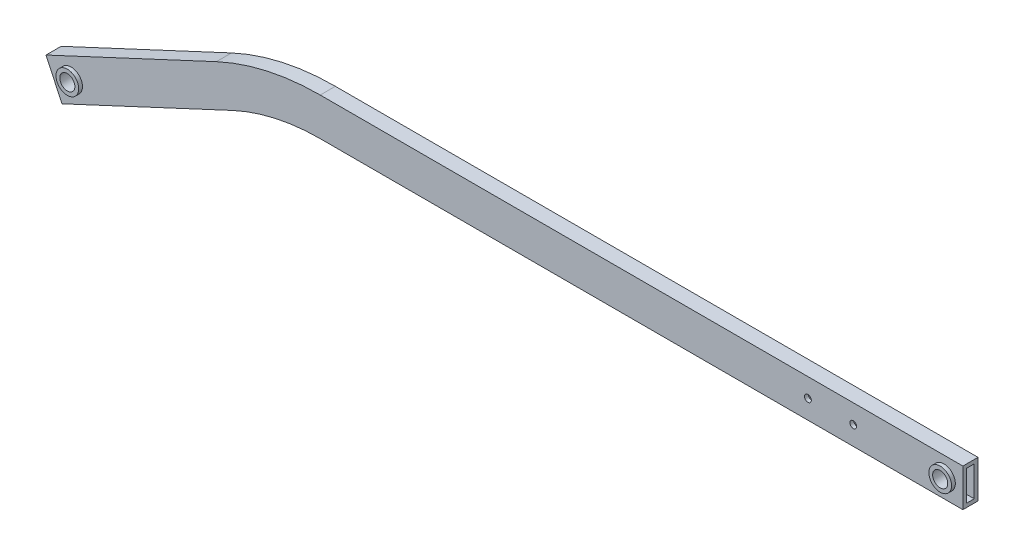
ISO-10303-21;
HEADER;
FILE_DESCRIPTION(('STEP AP214'),'2;1');
FILE_NAME('part.step','',(''),(''),'','','');
FILE_SCHEMA(('AUTOMOTIVE_DESIGN { 1 0 10303 214 1 1 1 1 }'));
ENDSEC;
DATA;
#1=APPLICATION_CONTEXT('core data for automotive mechanical design processes');
#2=APPLICATION_PROTOCOL_DEFINITION('international standard','automotive_design',2000,#1);
#3=PRODUCT_CONTEXT('',#1,'mechanical');
#4=PRODUCT('Part','Part','',(#3));
#5=PRODUCT_RELATED_PRODUCT_CATEGORY('part','',(#4));
#6=PRODUCT_DEFINITION_FORMATION('','',#4);
#7=PRODUCT_DEFINITION_CONTEXT('part definition',#1,'design');
#8=PRODUCT_DEFINITION('design','',#6,#7);
#9=PRODUCT_DEFINITION_SHAPE('','',#8);
#10=(LENGTH_UNIT() NAMED_UNIT(*) SI_UNIT(.MILLI.,.METRE.));
#11=(NAMED_UNIT(*) PLANE_ANGLE_UNIT() SI_UNIT($,.RADIAN.));
#12=(NAMED_UNIT(*) SI_UNIT($,.STERADIAN.) SOLID_ANGLE_UNIT());
#13=UNCERTAINTY_MEASURE_WITH_UNIT(LENGTH_MEASURE(1.E-05),#10,'distance_accuracy_value','');
#14=(GEOMETRIC_REPRESENTATION_CONTEXT(3) GLOBAL_UNCERTAINTY_ASSIGNED_CONTEXT((#13)) GLOBAL_UNIT_ASSIGNED_CONTEXT((#10,
#11,#12)) REPRESENTATION_CONTEXT('',''));
#15=CARTESIAN_POINT('',(0.,0.,0.));
#16=DIRECTION('',(0.,0.,1.));
#17=DIRECTION('',(1.,0.,0.));
#18=AXIS2_PLACEMENT_3D('',#15,#16,#17);
#19=CARTESIAN_POINT('',(-987.350935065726,-5.44996921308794,10.));
#20=DIRECTION('',(0.422618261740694,-0.906307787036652,0.));
#21=DIRECTION('',(0.906307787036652,0.422618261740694,0.));
#22=AXIS2_PLACEMENT_3D('',#19,#20,#21);
#23=PLANE('',#22);
#24=DIRECTION('',(0.,0.,1.));
#25=VECTOR('',#24,1.);
#26=CARTESIAN_POINT('',(-987.350935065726,-5.44996921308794,10.));
#27=LINE('',#26,#25);
#28=CARTESIAN_POINT('',(-987.350935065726,-5.44996921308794,-10.));
#29=VERTEX_POINT('',#28);
#30=CARTESIAN_POINT('',(-987.350935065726,-5.44996921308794,10.));
#31=VERTEX_POINT('',#30);
#32=EDGE_CURVE('E223',#29,#31,#27,.T.);
#33=ORIENTED_EDGE('',*,*,#32,.F.);
#34=DIRECTION('',(-0.906307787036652,-0.422618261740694,0.));
#35=VECTOR('',#34,1.);
#36=CARTESIAN_POINT('',(-987.350935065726,-5.44996921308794,-10.));
#37=LINE('',#36,#35);
#38=CARTESIAN_POINT('',(-1212.71545654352,-110.539171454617,-10.));
#39=VERTEX_POINT('',#38);
#40=EDGE_CURVE('E35',#29,#39,#37,.T.);
#41=ORIENTED_EDGE('',*,*,#40,.T.);
#42=DIRECTION('',(0.,0.,1.));
#43=VECTOR('',#42,1.);
#44=CARTESIAN_POINT('',(-1212.71545654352,-110.539171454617,10.));
#45=LINE('',#44,#43);
#46=CARTESIAN_POINT('',(-1212.71545654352,-110.539171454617,10.));
#47=VERTEX_POINT('',#46);
#48=EDGE_CURVE('E43',#39,#47,#45,.T.);
#49=ORIENTED_EDGE('',*,*,#48,.T.);
#50=DIRECTION('',(-0.906307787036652,-0.422618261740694,0.));
#51=VECTOR('',#50,1.);
#52=CARTESIAN_POINT('',(-987.350935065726,-5.44996921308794,10.));
#53=LINE('',#52,#51);
#54=EDGE_CURVE('E11',#31,#47,#53,.T.);
#55=ORIENTED_EDGE('',*,*,#54,.F.);
#56=EDGE_LOOP('',(#33,#41,#49,#55));
#57=FACE_BOUND('',#56,.T.);
#58=ADVANCED_FACE('F27',(#57),#23,.F.);
#59=CARTESIAN_POINT('',(-966.220021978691,-50.7653585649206,10.));
#60=DIRECTION('',(-0.422618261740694,0.906307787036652,0.));
#61=DIRECTION('',(-0.906307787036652,-0.422618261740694,0.));
#62=AXIS2_PLACEMENT_3D('',#59,#60,#61);
#63=PLANE('',#62);
#64=DIRECTION('',(0.,0.,-1.));
#65=VECTOR('',#64,1.);
#66=CARTESIAN_POINT('',(-966.220021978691,-50.7653585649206,10.));
#67=LINE('',#66,#65);
#68=CARTESIAN_POINT('',(-966.220021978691,-50.7653585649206,10.));
#69=VERTEX_POINT('',#68);
#70=CARTESIAN_POINT('',(-966.220021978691,-50.7653585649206,-10.));
#71=VERTEX_POINT('',#70);
#72=EDGE_CURVE('E220',#69,#71,#67,.T.);
#73=ORIENTED_EDGE('',*,*,#72,.F.);
#74=DIRECTION('',(-0.906307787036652,-0.422618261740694,0.));
#75=VECTOR('',#74,1.);
#76=CARTESIAN_POINT('',(-966.220021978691,-50.7653585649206,10.));
#77=LINE('',#76,#75);
#78=CARTESIAN_POINT('',(-1191.58454345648,-155.85456080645,10.));
#79=VERTEX_POINT('',#78);
#80=EDGE_CURVE('E268',#69,#79,#77,.T.);
#81=ORIENTED_EDGE('',*,*,#80,.T.);
#82=DIRECTION('',(0.,0.,-1.));
#83=VECTOR('',#82,1.);
#84=CARTESIAN_POINT('',(-1191.58454345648,-155.85456080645,10.));
#85=LINE('',#84,#83);
#86=CARTESIAN_POINT('',(-1191.58454345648,-155.85456080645,-10.));
#87=VERTEX_POINT('',#86);
#88=EDGE_CURVE('E263',#79,#87,#85,.T.);
#89=ORIENTED_EDGE('',*,*,#88,.T.);
#90=DIRECTION('',(-0.906307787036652,-0.422618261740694,0.));
#91=VECTOR('',#90,1.);
#92=CARTESIAN_POINT('',(-966.220021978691,-50.7653585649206,-10.));
#93=LINE('',#92,#91);
#94=EDGE_CURVE('E281',#71,#87,#93,.T.);
#95=ORIENTED_EDGE('',*,*,#94,.F.);
#96=EDGE_LOOP('',(#73,#81,#89,#95));
#97=FACE_BOUND('',#96,.T.);
#98=ADVANCED_FACE('F382',(#97),#63,.F.);
#99=CARTESIAN_POINT('',(-968.333113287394,-46.2338196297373,5.));
#100=DIRECTION('',(-0.422618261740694,0.906307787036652,0.));
#101=DIRECTION('',(-0.906307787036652,-0.422618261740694,0.));
#102=AXIS2_PLACEMENT_3D('',#99,#100,#101);
#103=PLANE('',#102);
#104=DIRECTION('',(0.,0.,-1.));
#105=VECTOR('',#104,1.);
#106=CARTESIAN_POINT('',(-968.333113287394,-46.2338196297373,5.));
#107=LINE('',#106,#105);
#108=CARTESIAN_POINT('',(-968.333113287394,-46.2338196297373,5.));
#109=VERTEX_POINT('',#108);
#110=CARTESIAN_POINT('',(-968.333113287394,-46.2338196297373,-5.));
#111=VERTEX_POINT('',#110);
#112=EDGE_CURVE('E217',#109,#111,#107,.T.);
#113=ORIENTED_EDGE('',*,*,#112,.T.);
#114=DIRECTION('',(-0.906307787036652,-0.422618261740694,0.));
#115=VECTOR('',#114,1.);
#116=CARTESIAN_POINT('',(-968.333113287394,-46.2338196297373,-5.));
#117=LINE('',#116,#115);
#118=CARTESIAN_POINT('',(-1193.69763476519,-151.323021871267,-5.));
#119=VERTEX_POINT('',#118);
#120=EDGE_CURVE('E274',#111,#119,#117,.T.);
#121=ORIENTED_EDGE('',*,*,#120,.T.);
#122=DIRECTION('',(0.,0.,-1.));
#123=VECTOR('',#122,1.);
#124=CARTESIAN_POINT('',(-1193.69763476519,-151.323021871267,5.));
#125=LINE('',#124,#123);
#126=CARTESIAN_POINT('',(-1193.69763476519,-151.323021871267,5.));
#127=VERTEX_POINT('',#126);
#128=EDGE_CURVE('E257',#127,#119,#125,.T.);
#129=ORIENTED_EDGE('',*,*,#128,.F.);
#130=DIRECTION('',(-0.906307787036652,-0.422618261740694,0.));
#131=VECTOR('',#130,1.);
#132=CARTESIAN_POINT('',(-968.333113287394,-46.2338196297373,5.));
#133=LINE('',#132,#131);
#134=EDGE_CURVE('E264',#109,#127,#133,.T.);
#135=ORIENTED_EDGE('',*,*,#134,.F.);
#136=EDGE_LOOP('',(#113,#121,#129,#135));
#137=FACE_BOUND('',#136,.T.);
#138=ADVANCED_FACE('F400',(#137),#103,.T.);
#139=CARTESIAN_POINT('',(-985.237843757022,-9.9815081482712,5.));
#140=DIRECTION('',(0.422618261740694,-0.906307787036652,0.));
#141=DIRECTION('',(0.906307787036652,0.422618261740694,0.));
#142=AXIS2_PLACEMENT_3D('',#139,#140,#141);
#143=PLANE('',#142);
#144=DIRECTION('',(0.,0.,1.));
#145=VECTOR('',#144,1.);
#146=CARTESIAN_POINT('',(-985.237843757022,-9.9815081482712,5.));
#147=LINE('',#146,#145);
#148=CARTESIAN_POINT('',(-985.237843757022,-9.9815081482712,-5.));
#149=VERTEX_POINT('',#148);
#150=CARTESIAN_POINT('',(-985.237843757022,-9.9815081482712,5.));
#151=VERTEX_POINT('',#150);
#152=EDGE_CURVE('E202',#149,#151,#147,.T.);
#153=ORIENTED_EDGE('',*,*,#152,.T.);
#154=DIRECTION('',(-0.906307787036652,-0.422618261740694,0.));
#155=VECTOR('',#154,1.);
#156=CARTESIAN_POINT('',(-985.237843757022,-9.9815081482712,5.));
#157=LINE('',#156,#155);
#158=CARTESIAN_POINT('',(-1210.60236523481,-115.070710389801,5.));
#159=VERTEX_POINT('',#158);
#160=EDGE_CURVE('E260',#151,#159,#157,.T.);
#161=ORIENTED_EDGE('',*,*,#160,.T.);
#162=DIRECTION('',(0.,0.,1.));
#163=VECTOR('',#162,1.);
#164=CARTESIAN_POINT('',(-1210.60236523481,-115.070710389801,5.));
#165=LINE('',#164,#163);
#166=CARTESIAN_POINT('',(-1210.60236523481,-115.070710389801,-5.));
#167=VERTEX_POINT('',#166);
#168=EDGE_CURVE('E251',#167,#159,#165,.T.);
#169=ORIENTED_EDGE('',*,*,#168,.F.);
#170=DIRECTION('',(-0.906307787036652,-0.422618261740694,0.));
#171=VECTOR('',#170,1.);
#172=CARTESIAN_POINT('',(-985.237843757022,-9.9815081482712,-5.));
#173=LINE('',#172,#171);
#174=EDGE_CURVE('E271',#149,#167,#173,.T.);
#175=ORIENTED_EDGE('',*,*,#174,.F.);
#176=EDGE_LOOP('',(#153,#161,#169,#175));
#177=FACE_BOUND('',#176,.T.);
#178=ADVANCED_FACE('F404',(#177),#143,.T.);
#179=CARTESIAN_POINT('',(-850.,-300.,0.));
#180=DIRECTION('',(0.,0.,1.));
#181=DIRECTION('',(1.,0.,0.));
#182=AXIS2_PLACEMENT_3D('',#179,#180,#181);
#183=CYLINDRICAL_SURFACE('',#182,325.);
#184=DIRECTION('',(0.,0.,1.));
#185=VECTOR('',#184,1.);
#186=CARTESIAN_POINT('',(-850.,25.,10.));
#187=LINE('',#186,#185);
#188=CARTESIAN_POINT('',(-850.,25.,-10.));
#189=VERTEX_POINT('',#188);
#190=CARTESIAN_POINT('',(-850.,25.,10.));
#191=VERTEX_POINT('',#190);
#192=EDGE_CURVE('E163',#189,#191,#187,.T.);
#193=ORIENTED_EDGE('',*,*,#192,.F.);
#194=CARTESIAN_POINT('',(-850.,-300.,-10.));
#195=DIRECTION('',(0.,0.,1.));
#196=DIRECTION('',(1.,0.,0.));
#197=AXIS2_PLACEMENT_3D('',#194,#195,#196);
#198=CIRCLE('',#197,325.);
#199=EDGE_CURVE('E242',#189,#29,#198,.T.);
#200=ORIENTED_EDGE('',*,*,#199,.T.);
#201=ORIENTED_EDGE('',*,*,#32,.T.);
#202=CARTESIAN_POINT('',(-850.,-300.,10.));
#203=DIRECTION('',(0.,0.,1.));
#204=DIRECTION('',(1.,0.,0.));
#205=AXIS2_PLACEMENT_3D('',#202,#203,#204);
#206=CIRCLE('',#205,325.);
#207=EDGE_CURVE('E245',#191,#31,#206,.T.);
#208=ORIENTED_EDGE('',*,*,#207,.F.);
#209=EDGE_LOOP('',(#193,#200,#201,#208));
#210=FACE_BOUND('',#209,.T.);
#211=ADVANCED_FACE('F370',(#210),#183,.T.);
#212=CARTESIAN_POINT('',(-850.,-300.,0.));
#213=DIRECTION('',(0.,0.,1.));
#214=DIRECTION('',(1.,0.,0.));
#215=AXIS2_PLACEMENT_3D('',#212,#213,#214);
#216=CYLINDRICAL_SURFACE('',#215,275.);
#217=DIRECTION('',(0.,0.,-1.));
#218=VECTOR('',#217,1.);
#219=CARTESIAN_POINT('',(-850.,-25.,10.));
#220=LINE('',#219,#218);
#221=CARTESIAN_POINT('',(-850.,-25.,10.));
#222=VERTEX_POINT('',#221);
#223=CARTESIAN_POINT('',(-850.,-25.,-10.));
#224=VERTEX_POINT('',#223);
#225=EDGE_CURVE('E195',#222,#224,#220,.T.);
#226=ORIENTED_EDGE('',*,*,#225,.F.);
#227=CARTESIAN_POINT('',(-850.,-300.,10.));
#228=DIRECTION('',(0.,0.,1.));
#229=DIRECTION('',(1.,0.,0.));
#230=AXIS2_PLACEMENT_3D('',#227,#228,#229);
#231=CIRCLE('',#230,275.);
#232=EDGE_CURVE('E227',#222,#69,#231,.T.);
#233=ORIENTED_EDGE('',*,*,#232,.T.);
#234=ORIENTED_EDGE('',*,*,#72,.T.);
#235=CARTESIAN_POINT('',(-850.,-300.,-10.));
#236=DIRECTION('',(0.,0.,1.));
#237=DIRECTION('',(1.,0.,0.));
#238=AXIS2_PLACEMENT_3D('',#235,#236,#237);
#239=CIRCLE('',#238,275.);
#240=EDGE_CURVE('E239',#224,#71,#239,.T.);
#241=ORIENTED_EDGE('',*,*,#240,.F.);
#242=EDGE_LOOP('',(#226,#233,#234,#241));
#243=FACE_BOUND('',#242,.T.);
#244=ADVANCED_FACE('F379',(#243),#216,.F.);
#245=CARTESIAN_POINT('',(-850.,-300.,0.));
#246=DIRECTION('',(0.,0.,1.));
#247=DIRECTION('',(1.,0.,0.));
#248=AXIS2_PLACEMENT_3D('',#245,#246,#247);
#249=CYLINDRICAL_SURFACE('',#248,280.);
#250=DIRECTION('',(0.,0.,-1.));
#251=VECTOR('',#250,1.);
#252=CARTESIAN_POINT('',(-850.,-20.,5.));
#253=LINE('',#252,#251);
#254=CARTESIAN_POINT('',(-850.,-20.,5.));
#255=VERTEX_POINT('',#254);
#256=CARTESIAN_POINT('',(-850.,-20.,-5.));
#257=VERTEX_POINT('',#256);
#258=EDGE_CURVE('E192',#255,#257,#253,.T.);
#259=ORIENTED_EDGE('',*,*,#258,.T.);
#260=CARTESIAN_POINT('',(-850.,-300.,-5.));
#261=DIRECTION('',(0.,0.,1.));
#262=DIRECTION('',(1.,0.,0.));
#263=AXIS2_PLACEMENT_3D('',#260,#261,#262);
#264=CIRCLE('',#263,280.);
#265=EDGE_CURVE('E232',#257,#111,#264,.T.);
#266=ORIENTED_EDGE('',*,*,#265,.T.);
#267=ORIENTED_EDGE('',*,*,#112,.F.);
#268=CARTESIAN_POINT('',(-850.,-300.,5.));
#269=DIRECTION('',(0.,0.,1.));
#270=DIRECTION('',(1.,0.,0.));
#271=AXIS2_PLACEMENT_3D('',#268,#269,#270);
#272=CIRCLE('',#271,280.);
#273=EDGE_CURVE('E224',#255,#109,#272,.T.);
#274=ORIENTED_EDGE('',*,*,#273,.F.);
#275=EDGE_LOOP('',(#259,#266,#267,#274));
#276=FACE_BOUND('',#275,.T.);
#277=ADVANCED_FACE('F415',(#276),#249,.T.);
#278=CARTESIAN_POINT('',(-850.,-300.,0.));
#279=DIRECTION('',(0.,0.,1.));
#280=DIRECTION('',(1.,0.,0.));
#281=AXIS2_PLACEMENT_3D('',#278,#279,#280);
#282=CYLINDRICAL_SURFACE('',#281,320.);
#283=DIRECTION('',(0.,0.,1.));
#284=VECTOR('',#283,1.);
#285=CARTESIAN_POINT('',(-850.,20.,5.));
#286=LINE('',#285,#284);
#287=CARTESIAN_POINT('',(-850.,20.,-5.));
#288=VERTEX_POINT('',#287);
#289=CARTESIAN_POINT('',(-850.,20.,5.));
#290=VERTEX_POINT('',#289);
#291=EDGE_CURVE('E190',#288,#290,#286,.T.);
#292=ORIENTED_EDGE('',*,*,#291,.T.);
#293=CARTESIAN_POINT('',(-850.,-300.,5.));
#294=DIRECTION('',(0.,0.,1.));
#295=DIRECTION('',(1.,0.,0.));
#296=AXIS2_PLACEMENT_3D('',#293,#294,#295);
#297=CIRCLE('',#296,320.);
#298=EDGE_CURVE('E161',#290,#151,#297,.T.);
#299=ORIENTED_EDGE('',*,*,#298,.T.);
#300=ORIENTED_EDGE('',*,*,#152,.F.);
#301=CARTESIAN_POINT('',(-850.,-300.,-5.));
#302=DIRECTION('',(0.,0.,1.));
#303=DIRECTION('',(1.,0.,0.));
#304=AXIS2_PLACEMENT_3D('',#301,#302,#303);
#305=CIRCLE('',#304,320.);
#306=EDGE_CURVE('E229',#288,#149,#305,.T.);
#307=ORIENTED_EDGE('',*,*,#306,.F.);
#308=EDGE_LOOP('',(#292,#299,#300,#307));
#309=FACE_BOUND('',#308,.T.);
#310=ADVANCED_FACE('F355',(#309),#282,.F.);
#311=CARTESIAN_POINT('',(-850.,25.,10.));
#312=DIRECTION('',(0.,0.,1.));
#313=DIRECTION('',(0.,-1.,0.));
#314=AXIS2_PLACEMENT_3D('',#311,#312,#313);
#315=PLANE('',#314);
#316=CARTESIAN_POINT('',(-205.,0.,10.));
#317=DIRECTION('',(0.,0.,1.));
#318=DIRECTION('',(0.,-1.,0.));
#319=AXIS2_PLACEMENT_3D('',#316,#317,#318);
#320=CIRCLE('',#319,4.49999999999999);
#321=CARTESIAN_POINT('',(-205.,-4.49999999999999,10.));
#322=VERTEX_POINT('',#321);
#323=EDGE_CURVE('E293',#322,#322,#320,.T.);
#324=ORIENTED_EDGE('',*,*,#323,.F.);
#325=EDGE_LOOP('',(#324));
#326=FACE_BOUND('',#325,.T.);
#327=CARTESIAN_POINT('',(-145.,0.,10.));
#328=DIRECTION('',(0.,0.,1.));
#329=DIRECTION('',(0.,-1.,0.));
#330=AXIS2_PLACEMENT_3D('',#327,#328,#329);
#331=CIRCLE('',#330,4.49999999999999);
#332=CARTESIAN_POINT('',(-145.,-4.49999999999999,10.));
#333=VERTEX_POINT('',#332);
#334=EDGE_CURVE('E290',#333,#333,#331,.T.);
#335=ORIENTED_EDGE('',*,*,#334,.F.);
#336=EDGE_LOOP('',(#335));
#337=FACE_BOUND('',#336,.T.);
#338=CARTESIAN_POINT('',(-1179.49230532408,-122.631409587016,10.));
#339=DIRECTION('',(0.,0.,1.));
#340=DIRECTION('',(1.,0.,0.));
#341=AXIS2_PLACEMENT_3D('',#338,#339,#340);
#342=CIRCLE('',#341,14.9999999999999);
#343=CARTESIAN_POINT('',(-1164.49230532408,-122.631409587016,10.));
#344=VERTEX_POINT('',#343);
#345=EDGE_CURVE('E172',#344,#344,#342,.T.);
#346=ORIENTED_EDGE('',*,*,#345,.F.);
#347=EDGE_LOOP('',(#346));
#348=FACE_BOUND('',#347,.T.);
#349=CARTESIAN_POINT('',(-25.,0.,10.));
#350=DIRECTION('',(0.,0.,1.));
#351=DIRECTION('',(1.,0.,0.));
#352=AXIS2_PLACEMENT_3D('',#349,#350,#351);
#353=CIRCLE('',#352,15.);
#354=CARTESIAN_POINT('',(-10.,0.,10.));
#355=VERTEX_POINT('',#354);
#356=EDGE_CURVE('E169',#355,#355,#353,.T.);
#357=ORIENTED_EDGE('',*,*,#356,.F.);
#358=EDGE_LOOP('',(#357));
#359=FACE_BOUND('',#358,.T.);
#360=DIRECTION('',(0.,-1.,0.));
#361=VECTOR('',#360,1.);
#362=CARTESIAN_POINT('',(0.,25.,10.));
#363=LINE('',#362,#361);
#364=CARTESIAN_POINT('',(0.,25.,10.));
#365=VERTEX_POINT('',#364);
#366=CARTESIAN_POINT('',(0.,-25.,10.));
#367=VERTEX_POINT('',#366);
#368=EDGE_CURVE('E178',#365,#367,#363,.T.);
#369=ORIENTED_EDGE('',*,*,#368,.F.);
#370=DIRECTION('',(1.,0.,0.));
#371=VECTOR('',#370,1.);
#372=CARTESIAN_POINT('',(-850.,25.,10.));
#373=LINE('',#372,#371);
#374=EDGE_CURVE('E200',#191,#365,#373,.T.);
#375=ORIENTED_EDGE('',*,*,#374,.F.);
#376=ORIENTED_EDGE('',*,*,#207,.T.);
#377=ORIENTED_EDGE('',*,*,#54,.T.);
#378=DIRECTION('',(0.422618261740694,-0.906307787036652,0.));
#379=VECTOR('',#378,1.);
#380=CARTESIAN_POINT('',(-1212.71545654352,-110.539171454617,10.));
#381=LINE('',#380,#379);
#382=EDGE_CURVE('E261',#47,#79,#381,.T.);
#383=ORIENTED_EDGE('',*,*,#382,.T.);
#384=ORIENTED_EDGE('',*,*,#80,.F.);
#385=ORIENTED_EDGE('',*,*,#232,.F.);
#386=DIRECTION('',(1.,0.,0.));
#387=VECTOR('',#386,1.);
#388=CARTESIAN_POINT('',(-850.,-25.,10.));
#389=LINE('',#388,#387);
#390=EDGE_CURVE('E207',#222,#367,#389,.T.);
#391=ORIENTED_EDGE('',*,*,#390,.T.);
#392=EDGE_LOOP('',(#369,#375,#376,#377,#383,#384,#385,#391));
#393=FACE_BOUND('',#392,.T.);
#394=ADVANCED_FACE('F351',(#326,#337,#348,#359,#393),#315,.T.);
#395=CARTESIAN_POINT('',(-850.,25.,10.));
#396=DIRECTION('',(0.,1.,0.));
#397=DIRECTION('',(0.,0.,1.));
#398=AXIS2_PLACEMENT_3D('',#395,#396,#397);
#399=PLANE('',#398);
#400=DIRECTION('',(0.,0.,1.));
#401=VECTOR('',#400,1.);
#402=CARTESIAN_POINT('',(0.,25.,10.));
#403=LINE('',#402,#401);
#404=CARTESIAN_POINT('',(0.,25.,-10.));
#405=VERTEX_POINT('',#404);
#406=EDGE_CURVE('E187',#405,#365,#403,.T.);
#407=ORIENTED_EDGE('',*,*,#406,.F.);
#408=DIRECTION('',(1.,0.,0.));
#409=VECTOR('',#408,1.);
#410=CARTESIAN_POINT('',(-850.,25.,-10.));
#411=LINE('',#410,#409);
#412=EDGE_CURVE('E203',#189,#405,#411,.T.);
#413=ORIENTED_EDGE('',*,*,#412,.F.);
#414=ORIENTED_EDGE('',*,*,#192,.T.);
#415=ORIENTED_EDGE('',*,*,#374,.T.);
#416=EDGE_LOOP('',(#407,#413,#414,#415));
#417=FACE_BOUND('',#416,.T.);
#418=ADVANCED_FACE('F354',(#417),#399,.T.);
#419=CARTESIAN_POINT('',(-850.,25.,-10.));
#420=DIRECTION('',(0.,0.,-1.));
#421=DIRECTION('',(0.,1.,0.));
#422=AXIS2_PLACEMENT_3D('',#419,#420,#421);
#423=PLANE('',#422);
#424=CARTESIAN_POINT('',(-205.,0.,-10.));
#425=DIRECTION('',(0.,0.,-1.));
#426=DIRECTION('',(0.,1.,0.));
#427=AXIS2_PLACEMENT_3D('',#424,#425,#426);
#428=CIRCLE('',#427,4.49999999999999);
#429=CARTESIAN_POINT('',(-205.,4.49999999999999,-10.));
#430=VERTEX_POINT('',#429);
#431=EDGE_CURVE('E590',#430,#430,#428,.T.);
#432=ORIENTED_EDGE('',*,*,#431,.F.);
#433=EDGE_LOOP('',(#432));
#434=FACE_BOUND('',#433,.T.);
#435=CARTESIAN_POINT('',(-145.,0.,-10.));
#436=DIRECTION('',(0.,0.,-1.));
#437=DIRECTION('',(0.,1.,0.));
#438=AXIS2_PLACEMENT_3D('',#435,#436,#437);
#439=CIRCLE('',#438,4.49999999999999);
#440=CARTESIAN_POINT('',(-145.,4.49999999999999,-10.));
#441=VERTEX_POINT('',#440);
#442=EDGE_CURVE('E286',#441,#441,#439,.T.);
#443=ORIENTED_EDGE('',*,*,#442,.F.);
#444=EDGE_LOOP('',(#443));
#445=FACE_BOUND('',#444,.T.);
#446=CARTESIAN_POINT('',(-1179.49230532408,-122.631409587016,-10.));
#447=DIRECTION('',(0.,0.,-1.));
#448=DIRECTION('',(0.,1.,0.));
#449=AXIS2_PLACEMENT_3D('',#446,#447,#448);
#450=CIRCLE('',#449,14.9999999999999);
#451=CARTESIAN_POINT('',(-1179.49230532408,-107.631409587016,-10.));
#452=VERTEX_POINT('',#451);
#453=EDGE_CURVE('E322',#452,#452,#450,.F.);
#454=ORIENTED_EDGE('',*,*,#453,.T.);
#455=EDGE_LOOP('',(#454));
#456=FACE_BOUND('',#455,.T.);
#457=CARTESIAN_POINT('',(-25.,0.,-10.));
#458=DIRECTION('',(0.,0.,-1.));
#459=DIRECTION('',(0.,1.,0.));
#460=AXIS2_PLACEMENT_3D('',#457,#458,#459);
#461=CIRCLE('',#460,15.);
#462=CARTESIAN_POINT('',(-25.,15.,-10.));
#463=VERTEX_POINT('',#462);
#464=EDGE_CURVE('E343',#463,#463,#461,.F.);
#465=ORIENTED_EDGE('',*,*,#464,.T.);
#466=EDGE_LOOP('',(#465));
#467=FACE_BOUND('',#466,.T.);
#468=DIRECTION('',(0.,1.,0.));
#469=VECTOR('',#468,1.);
#470=CARTESIAN_POINT('',(0.,25.,-10.));
#471=LINE('',#470,#469);
#472=CARTESIAN_POINT('',(0.,-25.,-10.));
#473=VERTEX_POINT('',#472);
#474=EDGE_CURVE('E184',#473,#405,#471,.T.);
#475=ORIENTED_EDGE('',*,*,#474,.F.);
#476=DIRECTION('',(1.,0.,0.));
#477=VECTOR('',#476,1.);
#478=CARTESIAN_POINT('',(-850.,-25.,-10.));
#479=LINE('',#478,#477);
#480=EDGE_CURVE('E205',#224,#473,#479,.T.);
#481=ORIENTED_EDGE('',*,*,#480,.F.);
#482=ORIENTED_EDGE('',*,*,#240,.T.);
#483=ORIENTED_EDGE('',*,*,#94,.T.);
#484=DIRECTION('',(-0.422618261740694,0.906307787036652,0.));
#485=VECTOR('',#484,1.);
#486=CARTESIAN_POINT('',(-1212.71545654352,-110.539171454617,-10.));
#487=LINE('',#486,#485);
#488=EDGE_CURVE('E51',#87,#39,#487,.T.);
#489=ORIENTED_EDGE('',*,*,#488,.T.);
#490=ORIENTED_EDGE('',*,*,#40,.F.);
#491=ORIENTED_EDGE('',*,*,#199,.F.);
#492=ORIENTED_EDGE('',*,*,#412,.T.);
#493=EDGE_LOOP('',(#475,#481,#482,#483,#489,#490,#491,#492));
#494=FACE_BOUND('',#493,.T.);
#495=ADVANCED_FACE('F373',(#434,#445,#456,#467,#494),#423,.T.);
#496=CARTESIAN_POINT('',(-850.,20.,5.));
#497=DIRECTION('',(0.,0.,1.));
#498=DIRECTION('',(0.,-1.,0.));
#499=AXIS2_PLACEMENT_3D('',#496,#497,#498);
#500=PLANE('',#499);
#501=CARTESIAN_POINT('',(-205.,0.,5.));
#502=DIRECTION('',(0.,0.,1.));
#503=DIRECTION('',(0.,-1.,0.));
#504=AXIS2_PLACEMENT_3D('',#501,#502,#503);
#505=CIRCLE('',#504,4.49999999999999);
#506=CARTESIAN_POINT('',(-205.,-4.49999999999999,5.));
#507=VERTEX_POINT('',#506);
#508=EDGE_CURVE('E298',#507,#507,#505,.T.);
#509=ORIENTED_EDGE('',*,*,#508,.T.);
#510=EDGE_LOOP('',(#509));
#511=FACE_BOUND('',#510,.T.);
#512=CARTESIAN_POINT('',(-145.,0.,5.));
#513=DIRECTION('',(0.,0.,1.));
#514=DIRECTION('',(0.,-1.,0.));
#515=AXIS2_PLACEMENT_3D('',#512,#513,#514);
#516=CIRCLE('',#515,4.49999999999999);
#517=CARTESIAN_POINT('',(-145.,-4.49999999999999,5.));
#518=VERTEX_POINT('',#517);
#519=EDGE_CURVE('E285',#518,#518,#516,.T.);
#520=ORIENTED_EDGE('',*,*,#519,.T.);
#521=EDGE_LOOP('',(#520));
#522=FACE_BOUND('',#521,.T.);
#523=CARTESIAN_POINT('',(-1179.49230532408,-122.631409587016,4.99999999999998));
#524=DIRECTION('',(0.,0.,1.));
#525=DIRECTION('',(0.,-1.,0.));
#526=AXIS2_PLACEMENT_3D('',#523,#524,#525);
#527=CIRCLE('',#526,14.9999999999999);
#528=CARTESIAN_POINT('',(-1179.49230532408,-137.631409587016,4.99999999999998));
#529=VERTEX_POINT('',#528);
#530=EDGE_CURVE('E319',#529,#529,#527,.F.);
#531=ORIENTED_EDGE('',*,*,#530,.F.);
#532=EDGE_LOOP('',(#531));
#533=FACE_BOUND('',#532,.T.);
#534=CARTESIAN_POINT('',(-25.,0.,5.));
#535=DIRECTION('',(0.,0.,1.));
#536=DIRECTION('',(0.,-1.,0.));
#537=AXIS2_PLACEMENT_3D('',#534,#535,#536);
#538=CIRCLE('',#537,15.);
#539=CARTESIAN_POINT('',(-25.,-15.,5.));
#540=VERTEX_POINT('',#539);
#541=EDGE_CURVE('E340',#540,#540,#538,.F.);
#542=ORIENTED_EDGE('',*,*,#541,.F.);
#543=EDGE_LOOP('',(#542));
#544=FACE_BOUND('',#543,.T.);
#545=DIRECTION('',(0.,-1.,0.));
#546=VECTOR('',#545,1.);
#547=CARTESIAN_POINT('',(0.,20.,5.));
#548=LINE('',#547,#546);
#549=CARTESIAN_POINT('',(0.,20.,5.));
#550=VERTEX_POINT('',#549);
#551=CARTESIAN_POINT('',(0.,-20.,5.));
#552=VERTEX_POINT('',#551);
#553=EDGE_CURVE('E154',#550,#552,#548,.T.);
#554=ORIENTED_EDGE('',*,*,#553,.T.);
#555=DIRECTION('',(1.,0.,0.));
#556=VECTOR('',#555,1.);
#557=CARTESIAN_POINT('',(-850.,-20.,5.));
#558=LINE('',#557,#556);
#559=EDGE_CURVE('E209',#255,#552,#558,.T.);
#560=ORIENTED_EDGE('',*,*,#559,.F.);
#561=ORIENTED_EDGE('',*,*,#273,.T.);
#562=ORIENTED_EDGE('',*,*,#134,.T.);
#563=DIRECTION('',(0.422618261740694,-0.906307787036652,0.));
#564=VECTOR('',#563,1.);
#565=CARTESIAN_POINT('',(-1210.60236523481,-115.070710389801,5.));
#566=LINE('',#565,#564);
#567=EDGE_CURVE('E248',#159,#127,#566,.T.);
#568=ORIENTED_EDGE('',*,*,#567,.F.);
#569=ORIENTED_EDGE('',*,*,#160,.F.);
#570=ORIENTED_EDGE('',*,*,#298,.F.);
#571=DIRECTION('',(1.,0.,0.));
#572=VECTOR('',#571,1.);
#573=CARTESIAN_POINT('',(-850.,20.,5.));
#574=LINE('',#573,#572);
#575=EDGE_CURVE('E147',#290,#550,#574,.T.);
#576=ORIENTED_EDGE('',*,*,#575,.T.);
#577=EDGE_LOOP('',(#554,#560,#561,#562,#568,#569,#570,#576));
#578=FACE_BOUND('',#577,.T.);
#579=ADVANCED_FACE('F158',(#511,#522,#533,#544,#578),#500,.F.);
#580=CARTESIAN_POINT('',(-850.,-20.,5.));
#581=DIRECTION('',(0.,-1.,0.));
#582=DIRECTION('',(0.,0.,-1.));
#583=AXIS2_PLACEMENT_3D('',#580,#581,#582);
#584=PLANE('',#583);
#585=DIRECTION('',(0.,0.,-1.));
#586=VECTOR('',#585,1.);
#587=CARTESIAN_POINT('',(0.,-20.,5.));
#588=LINE('',#587,#586);
#589=CARTESIAN_POINT('',(0.,-20.,-5.));
#590=VERTEX_POINT('',#589);
#591=EDGE_CURVE('E167',#552,#590,#588,.T.);
#592=ORIENTED_EDGE('',*,*,#591,.T.);
#593=DIRECTION('',(1.,0.,0.));
#594=VECTOR('',#593,1.);
#595=CARTESIAN_POINT('',(-850.,-20.,-5.));
#596=LINE('',#595,#594);
#597=EDGE_CURVE('E211',#257,#590,#596,.T.);
#598=ORIENTED_EDGE('',*,*,#597,.F.);
#599=ORIENTED_EDGE('',*,*,#258,.F.);
#600=ORIENTED_EDGE('',*,*,#559,.T.);
#601=EDGE_LOOP('',(#592,#598,#599,#600));
#602=FACE_BOUND('',#601,.T.);
#603=ADVANCED_FACE('F424',(#602),#584,.F.);
#604=CARTESIAN_POINT('',(-850.,20.,-5.));
#605=DIRECTION('',(0.,0.,-1.));
#606=DIRECTION('',(0.,1.,0.));
#607=AXIS2_PLACEMENT_3D('',#604,#605,#606);
#608=PLANE('',#607);
#609=CARTESIAN_POINT('',(-205.,0.,-5.));
#610=DIRECTION('',(0.,0.,-1.));
#611=DIRECTION('',(0.,1.,0.));
#612=AXIS2_PLACEMENT_3D('',#609,#610,#611);
#613=CIRCLE('',#612,4.49999999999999);
#614=CARTESIAN_POINT('',(-205.,4.49999999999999,-5.));
#615=VERTEX_POINT('',#614);
#616=EDGE_CURVE('E30',#615,#615,#613,.T.);
#617=ORIENTED_EDGE('',*,*,#616,.T.);
#618=EDGE_LOOP('',(#617));
#619=FACE_BOUND('',#618,.T.);
#620=CARTESIAN_POINT('',(-145.,0.,-5.));
#621=DIRECTION('',(0.,0.,-1.));
#622=DIRECTION('',(0.,1.,0.));
#623=AXIS2_PLACEMENT_3D('',#620,#621,#622);
#624=CIRCLE('',#623,4.49999999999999);
#625=CARTESIAN_POINT('',(-145.,4.49999999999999,-5.));
#626=VERTEX_POINT('',#625);
#627=EDGE_CURVE('E283',#626,#626,#624,.T.);
#628=ORIENTED_EDGE('',*,*,#627,.T.);
#629=EDGE_LOOP('',(#628));
#630=FACE_BOUND('',#629,.T.);
#631=CARTESIAN_POINT('',(-1179.49230532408,-122.631409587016,-5.00000000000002));
#632=DIRECTION('',(0.,0.,-1.));
#633=DIRECTION('',(0.,1.,0.));
#634=AXIS2_PLACEMENT_3D('',#631,#632,#633);
#635=CIRCLE('',#634,14.9999999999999);
#636=CARTESIAN_POINT('',(-1179.49230532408,-107.631409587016,-5.00000000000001));
#637=VERTEX_POINT('',#636);
#638=EDGE_CURVE('E316',#637,#637,#635,.F.);
#639=ORIENTED_EDGE('',*,*,#638,.F.);
#640=EDGE_LOOP('',(#639));
#641=FACE_BOUND('',#640,.T.);
#642=CARTESIAN_POINT('',(-25.,0.,-5.));
#643=DIRECTION('',(0.,0.,-1.));
#644=DIRECTION('',(0.,1.,0.));
#645=AXIS2_PLACEMENT_3D('',#642,#643,#644);
#646=CIRCLE('',#645,15.);
#647=CARTESIAN_POINT('',(-25.,15.,-5.));
#648=VERTEX_POINT('',#647);
#649=EDGE_CURVE('E337',#648,#648,#646,.F.);
#650=ORIENTED_EDGE('',*,*,#649,.F.);
#651=EDGE_LOOP('',(#650));
#652=FACE_BOUND('',#651,.T.);
#653=DIRECTION('',(0.,1.,0.));
#654=VECTOR('',#653,1.);
#655=CARTESIAN_POINT('',(0.,20.,-5.));
#656=LINE('',#655,#654);
#657=CARTESIAN_POINT('',(0.,20.,-5.));
#658=VERTEX_POINT('',#657);
#659=EDGE_CURVE('E153',#590,#658,#656,.T.);
#660=ORIENTED_EDGE('',*,*,#659,.T.);
#661=DIRECTION('',(1.,0.,0.));
#662=VECTOR('',#661,1.);
#663=CARTESIAN_POINT('',(-850.,20.,-5.));
#664=LINE('',#663,#662);
#665=EDGE_CURVE('E149',#288,#658,#664,.T.);
#666=ORIENTED_EDGE('',*,*,#665,.F.);
#667=ORIENTED_EDGE('',*,*,#306,.T.);
#668=ORIENTED_EDGE('',*,*,#174,.T.);
#669=DIRECTION('',(-0.422618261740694,0.906307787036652,0.));
#670=VECTOR('',#669,1.);
#671=CARTESIAN_POINT('',(-1210.60236523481,-115.070710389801,-5.));
#672=LINE('',#671,#670);
#673=EDGE_CURVE('E254',#119,#167,#672,.T.);
#674=ORIENTED_EDGE('',*,*,#673,.F.);
#675=ORIENTED_EDGE('',*,*,#120,.F.);
#676=ORIENTED_EDGE('',*,*,#265,.F.);
#677=ORIENTED_EDGE('',*,*,#597,.T.);
#678=EDGE_LOOP('',(#660,#666,#667,#668,#674,#675,#676,#677));
#679=FACE_BOUND('',#678,.T.);
#680=ADVANCED_FACE('F428',(#619,#630,#641,#652,#679),#608,.F.);
#681=CARTESIAN_POINT('',(-850.,20.,5.));
#682=DIRECTION('',(0.,1.,0.));
#683=DIRECTION('',(0.,0.,1.));
#684=AXIS2_PLACEMENT_3D('',#681,#682,#683);
#685=PLANE('',#684);
#686=DIRECTION('',(0.,0.,1.));
#687=VECTOR('',#686,1.);
#688=CARTESIAN_POINT('',(0.,20.,5.));
#689=LINE('',#688,#687);
#690=EDGE_CURVE('E143',#658,#550,#689,.T.);
#691=ORIENTED_EDGE('',*,*,#690,.T.);
#692=ORIENTED_EDGE('',*,*,#575,.F.);
#693=ORIENTED_EDGE('',*,*,#291,.F.);
#694=ORIENTED_EDGE('',*,*,#665,.T.);
#695=EDGE_LOOP('',(#691,#692,#693,#694));
#696=FACE_BOUND('',#695,.T.);
#697=ADVANCED_FACE('F145',(#696),#685,.F.);
#698=CARTESIAN_POINT('',(-850.,-25.,10.));
#699=DIRECTION('',(0.,-1.,0.));
#700=DIRECTION('',(0.,0.,-1.));
#701=AXIS2_PLACEMENT_3D('',#698,#699,#700);
#702=PLANE('',#701);
#703=DIRECTION('',(0.,0.,-1.));
#704=VECTOR('',#703,1.);
#705=CARTESIAN_POINT('',(0.,-25.,10.));
#706=LINE('',#705,#704);
#707=EDGE_CURVE('E181',#367,#473,#706,.T.);
#708=ORIENTED_EDGE('',*,*,#707,.F.);
#709=ORIENTED_EDGE('',*,*,#390,.F.);
#710=ORIENTED_EDGE('',*,*,#225,.T.);
#711=ORIENTED_EDGE('',*,*,#480,.T.);
#712=EDGE_LOOP('',(#708,#709,#710,#711));
#713=FACE_BOUND('',#712,.T.);
#714=ADVANCED_FACE('F376',(#713),#702,.T.);
#715=CARTESIAN_POINT('',(-1191.58454345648,-155.85456080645,10.));
#716=DIRECTION('',(0.906307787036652,0.422618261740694,0.));
#717=DIRECTION('',(0.,0.,-1.));
#718=AXIS2_PLACEMENT_3D('',#715,#716,#717);
#719=PLANE('',#718);
#720=ORIENTED_EDGE('',*,*,#567,.T.);
#721=ORIENTED_EDGE('',*,*,#128,.T.);
#722=ORIENTED_EDGE('',*,*,#673,.T.);
#723=ORIENTED_EDGE('',*,*,#168,.T.);
#724=EDGE_LOOP('',(#720,#721,#722,#723));
#725=FACE_BOUND('',#724,.T.);
#726=ORIENTED_EDGE('',*,*,#382,.F.);
#727=ORIENTED_EDGE('',*,*,#48,.F.);
#728=ORIENTED_EDGE('',*,*,#488,.F.);
#729=ORIENTED_EDGE('',*,*,#88,.F.);
#730=EDGE_LOOP('',(#726,#727,#728,#729));
#731=FACE_BOUND('',#730,.T.);
#732=ADVANCED_FACE('F384',(#725,#731),#719,.F.);
#733=CARTESIAN_POINT('',(0.,-25.,10.));
#734=DIRECTION('',(1.,0.,0.));
#735=DIRECTION('',(0.,0.,-1.));
#736=AXIS2_PLACEMENT_3D('',#733,#734,#735);
#737=PLANE('',#736);
#738=ORIENTED_EDGE('',*,*,#553,.F.);
#739=ORIENTED_EDGE('',*,*,#690,.F.);
#740=ORIENTED_EDGE('',*,*,#659,.F.);
#741=ORIENTED_EDGE('',*,*,#591,.F.);
#742=EDGE_LOOP('',(#738,#739,#740,#741));
#743=FACE_BOUND('',#742,.T.);
#744=ORIENTED_EDGE('',*,*,#368,.T.);
#745=ORIENTED_EDGE('',*,*,#707,.T.);
#746=ORIENTED_EDGE('',*,*,#474,.T.);
#747=ORIENTED_EDGE('',*,*,#406,.T.);
#748=EDGE_LOOP('',(#744,#745,#746,#747));
#749=FACE_BOUND('',#748,.T.);
#750=ADVANCED_FACE('F165',(#743,#749),#737,.T.);
#751=CARTESIAN_POINT('',(-25.,0.,15.));
#752=DIRECTION('',(0.,0.,-1.));
#753=DIRECTION('',(-1.,0.,0.));
#754=AXIS2_PLACEMENT_3D('',#751,#752,#753);
#755=CYLINDRICAL_SURFACE('',#754,15.);
#756=ORIENTED_EDGE('',*,*,#649,.T.);
#757=EDGE_LOOP('',(#756));
#758=FACE_BOUND('',#757,.T.);
#759=ORIENTED_EDGE('',*,*,#541,.T.);
#760=EDGE_LOOP('',(#759));
#761=FACE_BOUND('',#760,.T.);
#762=ADVANCED_FACE('F392',(#758,#761),#755,.T.);
#763=ORIENTED_EDGE('',*,*,#356,.T.);
#764=EDGE_LOOP('',(#763));
#765=FACE_BOUND('',#764,.T.);
#766=CARTESIAN_POINT('',(-25.,0.,15.));
#767=DIRECTION('',(0.,0.,1.));
#768=DIRECTION('',(1.,0.,0.));
#769=AXIS2_PLACEMENT_3D('',#766,#767,#768);
#770=CIRCLE('',#769,15.);
#771=CARTESIAN_POINT('',(-10.,0.,15.));
#772=VERTEX_POINT('',#771);
#773=EDGE_CURVE('E334',#772,#772,#770,.T.);
#774=ORIENTED_EDGE('',*,*,#773,.F.);
#775=EDGE_LOOP('',(#774));
#776=FACE_BOUND('',#775,.T.);
#777=ADVANCED_FACE('F472',(#765,#776),#755,.T.);
#778=CARTESIAN_POINT('',(-25.,0.,15.));
#779=DIRECTION('',(0.,0.,1.));
#780=DIRECTION('',(1.,0.,0.));
#781=AXIS2_PLACEMENT_3D('',#778,#779,#780);
#782=PLANE('',#781);
#783=ORIENTED_EDGE('',*,*,#773,.T.);
#784=EDGE_LOOP('',(#783));
#785=FACE_BOUND('',#784,.T.);
#786=CARTESIAN_POINT('',(-25.,0.,15.));
#787=DIRECTION('',(0.,0.,1.));
#788=DIRECTION('',(1.,0.,0.));
#789=AXIS2_PLACEMENT_3D('',#786,#787,#788);
#790=CIRCLE('',#789,10.);
#791=CARTESIAN_POINT('',(-15.,0.,15.));
#792=VERTEX_POINT('',#791);
#793=EDGE_CURVE('E331',#792,#792,#790,.T.);
#794=ORIENTED_EDGE('',*,*,#793,.F.);
#795=EDGE_LOOP('',(#794));
#796=FACE_BOUND('',#795,.T.);
#797=ADVANCED_FACE('F481',(#785,#796),#782,.T.);
#798=ORIENTED_EDGE('',*,*,#464,.F.);
#799=EDGE_LOOP('',(#798));
#800=FACE_BOUND('',#799,.T.);
#801=CARTESIAN_POINT('',(-25.,0.,-15.));
#802=DIRECTION('',(0.,0.,1.));
#803=DIRECTION('',(1.,0.,0.));
#804=AXIS2_PLACEMENT_3D('',#801,#802,#803);
#805=CIRCLE('',#804,15.);
#806=CARTESIAN_POINT('',(-10.,0.,-15.));
#807=VERTEX_POINT('',#806);
#808=EDGE_CURVE('E328',#807,#807,#805,.T.);
#809=ORIENTED_EDGE('',*,*,#808,.T.);
#810=EDGE_LOOP('',(#809));
#811=FACE_BOUND('',#810,.T.);
#812=ADVANCED_FACE('F475',(#800,#811),#755,.T.);
#813=CARTESIAN_POINT('',(-25.,0.,15.));
#814=DIRECTION('',(0.,0.,-1.));
#815=DIRECTION('',(-1.,0.,0.));
#816=AXIS2_PLACEMENT_3D('',#813,#814,#815);
#817=CYLINDRICAL_SURFACE('',#816,10.);
#818=ORIENTED_EDGE('',*,*,#793,.T.);
#819=EDGE_LOOP('',(#818));
#820=FACE_BOUND('',#819,.T.);
#821=CARTESIAN_POINT('',(-25.,0.,-15.));
#822=DIRECTION('',(0.,0.,1.));
#823=DIRECTION('',(1.,0.,0.));
#824=AXIS2_PLACEMENT_3D('',#821,#822,#823);
#825=CIRCLE('',#824,10.);
#826=CARTESIAN_POINT('',(-15.,0.,-15.));
#827=VERTEX_POINT('',#826);
#828=EDGE_CURVE('E325',#827,#827,#825,.T.);
#829=ORIENTED_EDGE('',*,*,#828,.F.);
#830=EDGE_LOOP('',(#829));
#831=FACE_BOUND('',#830,.T.);
#832=ADVANCED_FACE('F495',(#820,#831),#817,.F.);
#833=CARTESIAN_POINT('',(-25.,0.,-15.));
#834=DIRECTION('',(0.,0.,1.));
#835=DIRECTION('',(1.,0.,0.));
#836=AXIS2_PLACEMENT_3D('',#833,#834,#835);
#837=PLANE('',#836);
#838=ORIENTED_EDGE('',*,*,#828,.T.);
#839=EDGE_LOOP('',(#838));
#840=FACE_BOUND('',#839,.T.);
#841=ORIENTED_EDGE('',*,*,#808,.F.);
#842=EDGE_LOOP('',(#841));
#843=FACE_BOUND('',#842,.T.);
#844=ADVANCED_FACE('F502',(#840,#843),#837,.F.);
#845=CARTESIAN_POINT('',(-1179.49230532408,-122.631409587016,15.));
#846=DIRECTION('',(0.,0.,-1.));
#847=DIRECTION('',(-1.,0.,0.));
#848=AXIS2_PLACEMENT_3D('',#845,#846,#847);
#849=CYLINDRICAL_SURFACE('',#848,14.9999999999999);
#850=ORIENTED_EDGE('',*,*,#638,.T.);
#851=EDGE_LOOP('',(#850));
#852=FACE_BOUND('',#851,.T.);
#853=ORIENTED_EDGE('',*,*,#530,.T.);
#854=EDGE_LOOP('',(#853));
#855=FACE_BOUND('',#854,.T.);
#856=ADVANCED_FACE('F510',(#852,#855),#849,.T.);
#857=ORIENTED_EDGE('',*,*,#345,.T.);
#858=EDGE_LOOP('',(#857));
#859=FACE_BOUND('',#858,.T.);
#860=CARTESIAN_POINT('',(-1179.49230532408,-122.631409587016,15.));
#861=DIRECTION('',(0.,0.,1.));
#862=DIRECTION('',(1.,0.,0.));
#863=AXIS2_PLACEMENT_3D('',#860,#861,#862);
#864=CIRCLE('',#863,14.9999999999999);
#865=CARTESIAN_POINT('',(-1164.49230532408,-122.631409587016,15.));
#866=VERTEX_POINT('',#865);
#867=EDGE_CURVE('E313',#866,#866,#864,.T.);
#868=ORIENTED_EDGE('',*,*,#867,.F.);
#869=EDGE_LOOP('',(#868));
#870=FACE_BOUND('',#869,.T.);
#871=ADVANCED_FACE('F348',(#859,#870),#849,.T.);
#872=CARTESIAN_POINT('',(-1179.49230532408,-122.631409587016,15.));
#873=DIRECTION('',(0.,0.,1.));
#874=DIRECTION('',(1.,0.,0.));
#875=AXIS2_PLACEMENT_3D('',#872,#873,#874);
#876=PLANE('',#875);
#877=ORIENTED_EDGE('',*,*,#867,.T.);
#878=EDGE_LOOP('',(#877));
#879=FACE_BOUND('',#878,.T.);
#880=CARTESIAN_POINT('',(-1179.49230532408,-122.631409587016,15.));
#881=DIRECTION('',(0.,0.,1.));
#882=DIRECTION('',(1.,0.,0.));
#883=AXIS2_PLACEMENT_3D('',#880,#881,#882);
#884=CIRCLE('',#883,10.0000000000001);
#885=CARTESIAN_POINT('',(-1169.49230532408,-122.631409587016,15.));
#886=VERTEX_POINT('',#885);
#887=EDGE_CURVE('E310',#886,#886,#884,.T.);
#888=ORIENTED_EDGE('',*,*,#887,.F.);
#889=EDGE_LOOP('',(#888));
#890=FACE_BOUND('',#889,.T.);
#891=ADVANCED_FACE('F526',(#879,#890),#876,.T.);
#892=ORIENTED_EDGE('',*,*,#453,.F.);
#893=EDGE_LOOP('',(#892));
#894=FACE_BOUND('',#893,.T.);
#895=CARTESIAN_POINT('',(-1179.49230532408,-122.631409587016,-15.));
#896=DIRECTION('',(0.,0.,1.));
#897=DIRECTION('',(1.,0.,0.));
#898=AXIS2_PLACEMENT_3D('',#895,#896,#897);
#899=CIRCLE('',#898,14.9999999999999);
#900=CARTESIAN_POINT('',(-1164.49230532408,-122.631409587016,-15.));
#901=VERTEX_POINT('',#900);
#902=EDGE_CURVE('E307',#901,#901,#899,.T.);
#903=ORIENTED_EDGE('',*,*,#902,.T.);
#904=EDGE_LOOP('',(#903));
#905=FACE_BOUND('',#904,.T.);
#906=ADVANCED_FACE('F520',(#894,#905),#849,.T.);
#907=CARTESIAN_POINT('',(-1179.49230532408,-122.631409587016,15.));
#908=DIRECTION('',(0.,0.,-1.));
#909=DIRECTION('',(-1.,0.,0.));
#910=AXIS2_PLACEMENT_3D('',#907,#908,#909);
#911=CYLINDRICAL_SURFACE('',#910,10.0000000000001);
#912=ORIENTED_EDGE('',*,*,#887,.T.);
#913=EDGE_LOOP('',(#912));
#914=FACE_BOUND('',#913,.T.);
#915=CARTESIAN_POINT('',(-1179.49230532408,-122.631409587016,-15.));
#916=DIRECTION('',(0.,0.,1.));
#917=DIRECTION('',(1.,0.,0.));
#918=AXIS2_PLACEMENT_3D('',#915,#916,#917);
#919=CIRCLE('',#918,10.0000000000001);
#920=CARTESIAN_POINT('',(-1169.49230532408,-122.631409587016,-15.));
#921=VERTEX_POINT('',#920);
#922=EDGE_CURVE('E304',#921,#921,#919,.T.);
#923=ORIENTED_EDGE('',*,*,#922,.F.);
#924=EDGE_LOOP('',(#923));
#925=FACE_BOUND('',#924,.T.);
#926=ADVANCED_FACE('F539',(#914,#925),#911,.F.);
#927=CARTESIAN_POINT('',(-1179.49230532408,-122.631409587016,-15.));
#928=DIRECTION('',(0.,0.,1.));
#929=DIRECTION('',(1.,0.,0.));
#930=AXIS2_PLACEMENT_3D('',#927,#928,#929);
#931=PLANE('',#930);
#932=ORIENTED_EDGE('',*,*,#922,.T.);
#933=EDGE_LOOP('',(#932));
#934=FACE_BOUND('',#933,.T.);
#935=ORIENTED_EDGE('',*,*,#902,.F.);
#936=EDGE_LOOP('',(#935));
#937=FACE_BOUND('',#936,.T.);
#938=ADVANCED_FACE('F546',(#934,#937),#931,.F.);
#939=CARTESIAN_POINT('',(-145.,0.,15.));
#940=DIRECTION('',(0.,0.,-1.));
#941=DIRECTION('',(0.,1.,0.));
#942=AXIS2_PLACEMENT_3D('',#939,#940,#941);
#943=CYLINDRICAL_SURFACE('',#942,4.49999999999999);
#944=ORIENTED_EDGE('',*,*,#442,.T.);
#945=EDGE_LOOP('',(#944));
#946=FACE_BOUND('',#945,.T.);
#947=ORIENTED_EDGE('',*,*,#627,.F.);
#948=EDGE_LOOP('',(#947));
#949=FACE_BOUND('',#948,.T.);
#950=ADVANCED_FACE('F554',(#946,#949),#943,.F.);
#951=ORIENTED_EDGE('',*,*,#334,.T.);
#952=EDGE_LOOP('',(#951));
#953=FACE_BOUND('',#952,.T.);
#954=ORIENTED_EDGE('',*,*,#519,.F.);
#955=EDGE_LOOP('',(#954));
#956=FACE_BOUND('',#955,.T.);
#957=ADVANCED_FACE('F562',(#953,#956),#943,.F.);
#958=CARTESIAN_POINT('',(-205.,0.,15.));
#959=DIRECTION('',(0.,0.,-1.));
#960=DIRECTION('',(0.,1.,0.));
#961=AXIS2_PLACEMENT_3D('',#958,#959,#960);
#962=CYLINDRICAL_SURFACE('',#961,4.49999999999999);
#963=ORIENTED_EDGE('',*,*,#431,.T.);
#964=EDGE_LOOP('',(#963));
#965=FACE_BOUND('',#964,.T.);
#966=ORIENTED_EDGE('',*,*,#616,.F.);
#967=EDGE_LOOP('',(#966));
#968=FACE_BOUND('',#967,.T.);
#969=ADVANCED_FACE('F569',(#965,#968),#962,.F.);
#970=ORIENTED_EDGE('',*,*,#323,.T.);
#971=EDGE_LOOP('',(#970));
#972=FACE_BOUND('',#971,.T.);
#973=ORIENTED_EDGE('',*,*,#508,.F.);
#974=EDGE_LOOP('',(#973));
#975=FACE_BOUND('',#974,.T.);
#976=ADVANCED_FACE('F576',(#972,#975),#962,.F.);
#977=CLOSED_SHELL('',(#58,#98,#138,#178,#211,#244,#277,#310,#394,#418,#495,#579,#603,#680,#697,
#714,#732,#750,#762,#777,#797,#812,#832,#844,#856,#871,#891,#906,#926,#938,#950,#957,#969,#976));
#978=MANIFOLD_SOLID_BREP('B2',#977);
#979=ADVANCED_BREP_SHAPE_REPRESENTATION('',(#18,#978),#14);
#980=SHAPE_DEFINITION_REPRESENTATION(#9,#979);
ENDSEC;
END-ISO-10303-21;
